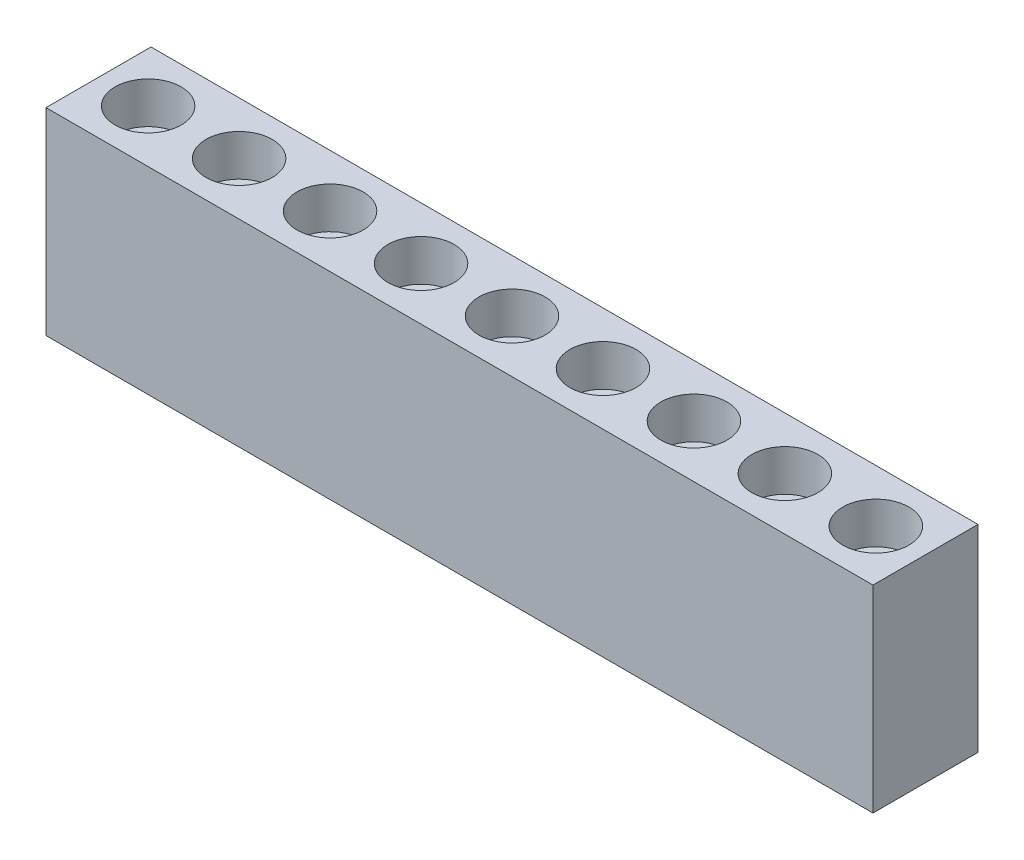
ISO-10303-21;
HEADER;
FILE_DESCRIPTION(('STEP AP214'),'2;1');
FILE_NAME('part.step','',(''),(''),'','','');
FILE_SCHEMA(('AUTOMOTIVE_DESIGN { 1 0 10303 214 1 1 1 1 }'));
ENDSEC;
DATA;
#1=APPLICATION_CONTEXT('core data for automotive mechanical design processes');
#2=APPLICATION_PROTOCOL_DEFINITION('international standard','automotive_design',2000,#1);
#3=PRODUCT_CONTEXT('',#1,'mechanical');
#4=PRODUCT('Part','Part','',(#3));
#5=PRODUCT_RELATED_PRODUCT_CATEGORY('part','',(#4));
#6=PRODUCT_DEFINITION_FORMATION('','',#4);
#7=PRODUCT_DEFINITION_CONTEXT('part definition',#1,'design');
#8=PRODUCT_DEFINITION('design','',#6,#7);
#9=PRODUCT_DEFINITION_SHAPE('','',#8);
#10=(LENGTH_UNIT() NAMED_UNIT(*) SI_UNIT(.MILLI.,.METRE.));
#11=(NAMED_UNIT(*) PLANE_ANGLE_UNIT() SI_UNIT($,.RADIAN.));
#12=(NAMED_UNIT(*) SI_UNIT($,.STERADIAN.) SOLID_ANGLE_UNIT());
#13=UNCERTAINTY_MEASURE_WITH_UNIT(LENGTH_MEASURE(1.E-05),#10,'distance_accuracy_value','');
#14=(GEOMETRIC_REPRESENTATION_CONTEXT(3) GLOBAL_UNCERTAINTY_ASSIGNED_CONTEXT((#13)) GLOBAL_UNIT_ASSIGNED_CONTEXT((#10,
#11,#12)) REPRESENTATION_CONTEXT('',''));
#15=CARTESIAN_POINT('',(0.,0.,0.));
#16=DIRECTION('',(0.,0.,1.));
#17=DIRECTION('',(1.,0.,0.));
#18=AXIS2_PLACEMENT_3D('',#15,#16,#17);
#19=CARTESIAN_POINT('',(88.,-35.1887084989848,0.));
#20=DIRECTION('',(0.,1.,0.));
#21=DIRECTION('',(-1.,0.,0.));
#22=AXIS2_PLACEMENT_3D('',#19,#20,#21);
#23=CYLINDRICAL_SURFACE('',#22,4.00000000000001);
#24=CARTESIAN_POINT('',(88.,-23.875,0.));
#25=DIRECTION('',(0.,1.,0.));
#26=DIRECTION('',(-1.,0.,0.));
#27=AXIS2_PLACEMENT_3D('',#24,#25,#26);
#28=CIRCLE('',#27,4.00000000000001);
#29=CARTESIAN_POINT('',(84.,-23.875,0.));
#30=VERTEX_POINT('',#29);
#31=EDGE_CURVE('E227',#30,#30,#28,.F.);
#32=ORIENTED_EDGE('',*,*,#31,.T.);
#33=EDGE_LOOP('',(#32));
#34=FACE_BOUND('',#33,.T.);
#35=CARTESIAN_POINT('',(88.,13.875,0.));
#36=DIRECTION('',(0.,1.,0.));
#37=DIRECTION('',(-1.,0.,0.));
#38=AXIS2_PLACEMENT_3D('',#35,#36,#37);
#39=CIRCLE('',#38,4.00000000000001);
#40=CARTESIAN_POINT('',(84.,13.875,0.));
#41=VERTEX_POINT('',#40);
#42=EDGE_CURVE('E11',#41,#41,#39,.T.);
#43=ORIENTED_EDGE('',*,*,#42,.T.);
#44=EDGE_LOOP('',(#43));
#45=FACE_BOUND('',#44,.T.);
#46=ADVANCED_FACE('F39',(#34,#45),#23,.F.);
#47=CARTESIAN_POINT('',(88.,13.875,0.));
#48=DIRECTION('',(0.,1.,0.));
#49=DIRECTION('',(-1.,0.,0.));
#50=AXIS2_PLACEMENT_3D('',#47,#48,#49);
#51=PLANE('',#50);
#52=ORIENTED_EDGE('',*,*,#42,.F.);
#53=EDGE_LOOP('',(#52));
#54=FACE_BOUND('',#53,.T.);
#55=CARTESIAN_POINT('',(88.,13.875,0.));
#56=DIRECTION('',(0.,1.,0.));
#57=DIRECTION('',(-1.,0.,0.));
#58=AXIS2_PLACEMENT_3D('',#55,#56,#57);
#59=CIRCLE('',#58,8.);
#60=CARTESIAN_POINT('',(80.,13.875,0.));
#61=VERTEX_POINT('',#60);
#62=EDGE_CURVE('E48',#61,#61,#59,.T.);
#63=ORIENTED_EDGE('',*,*,#62,.T.);
#64=EDGE_LOOP('',(#63));
#65=FACE_BOUND('',#64,.T.);
#66=ADVANCED_FACE('F238',(#54,#65),#51,.T.);
#67=CARTESIAN_POINT('',(88.,13.875,0.));
#68=DIRECTION('',(0.,1.,0.));
#69=DIRECTION('',(-1.,0.,0.));
#70=AXIS2_PLACEMENT_3D('',#67,#68,#69);
#71=CYLINDRICAL_SURFACE('',#70,8.);
#72=ORIENTED_EDGE('',*,*,#62,.F.);
#73=EDGE_LOOP('',(#72));
#74=FACE_BOUND('',#73,.T.);
#75=CARTESIAN_POINT('',(88.,23.875,0.));
#76=DIRECTION('',(0.,1.,0.));
#77=DIRECTION('',(-1.,0.,0.));
#78=AXIS2_PLACEMENT_3D('',#75,#76,#77);
#79=CIRCLE('',#78,8.);
#80=CARTESIAN_POINT('',(80.,23.875,0.));
#81=VERTEX_POINT('',#80);
#82=EDGE_CURVE('E230',#81,#81,#79,.T.);
#83=ORIENTED_EDGE('',*,*,#82,.T.);
#84=EDGE_LOOP('',(#83));
#85=FACE_BOUND('',#84,.T.);
#86=ADVANCED_FACE('F240',(#74,#85),#71,.F.);
#87=CARTESIAN_POINT('',(66.,-35.1887084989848,0.));
#88=DIRECTION('',(0.,1.,0.));
#89=DIRECTION('',(-1.,0.,0.));
#90=AXIS2_PLACEMENT_3D('',#87,#88,#89);
#91=CYLINDRICAL_SURFACE('',#90,4.00000000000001);
#92=CARTESIAN_POINT('',(66.,-23.875,0.));
#93=DIRECTION('',(0.,1.,0.));
#94=DIRECTION('',(-1.,0.,0.));
#95=AXIS2_PLACEMENT_3D('',#92,#93,#94);
#96=CIRCLE('',#95,4.00000000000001);
#97=CARTESIAN_POINT('',(62.,-23.875,0.));
#98=VERTEX_POINT('',#97);
#99=EDGE_CURVE('E211',#98,#98,#96,.F.);
#100=ORIENTED_EDGE('',*,*,#99,.T.);
#101=EDGE_LOOP('',(#100));
#102=FACE_BOUND('',#101,.T.);
#103=CARTESIAN_POINT('',(66.,13.875,0.));
#104=DIRECTION('',(0.,1.,0.));
#105=DIRECTION('',(-1.,0.,0.));
#106=AXIS2_PLACEMENT_3D('',#103,#104,#105);
#107=CIRCLE('',#106,4.00000000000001);
#108=CARTESIAN_POINT('',(62.,13.875,0.));
#109=VERTEX_POINT('',#108);
#110=EDGE_CURVE('E223',#109,#109,#107,.T.);
#111=ORIENTED_EDGE('',*,*,#110,.T.);
#112=EDGE_LOOP('',(#111));
#113=FACE_BOUND('',#112,.T.);
#114=ADVANCED_FACE('F243',(#102,#113),#91,.F.);
#115=CARTESIAN_POINT('',(66.,13.875,0.));
#116=DIRECTION('',(0.,1.,0.));
#117=DIRECTION('',(-1.,0.,0.));
#118=AXIS2_PLACEMENT_3D('',#115,#116,#117);
#119=PLANE('',#118);
#120=ORIENTED_EDGE('',*,*,#110,.F.);
#121=EDGE_LOOP('',(#120));
#122=FACE_BOUND('',#121,.T.);
#123=CARTESIAN_POINT('',(66.,13.875,0.));
#124=DIRECTION('',(0.,1.,0.));
#125=DIRECTION('',(-1.,0.,0.));
#126=AXIS2_PLACEMENT_3D('',#123,#124,#125);
#127=CIRCLE('',#126,8.);
#128=CARTESIAN_POINT('',(58.,13.875,0.));
#129=VERTEX_POINT('',#128);
#130=EDGE_CURVE('E219',#129,#129,#127,.T.);
#131=ORIENTED_EDGE('',*,*,#130,.T.);
#132=EDGE_LOOP('',(#131));
#133=FACE_BOUND('',#132,.T.);
#134=ADVANCED_FACE('F346',(#122,#133),#119,.T.);
#135=CARTESIAN_POINT('',(66.,13.875,0.));
#136=DIRECTION('',(0.,1.,0.));
#137=DIRECTION('',(-1.,0.,0.));
#138=AXIS2_PLACEMENT_3D('',#135,#136,#137);
#139=CYLINDRICAL_SURFACE('',#138,8.);
#140=ORIENTED_EDGE('',*,*,#130,.F.);
#141=EDGE_LOOP('',(#140));
#142=FACE_BOUND('',#141,.T.);
#143=CARTESIAN_POINT('',(66.,23.875,0.));
#144=DIRECTION('',(0.,1.,0.));
#145=DIRECTION('',(-1.,0.,0.));
#146=AXIS2_PLACEMENT_3D('',#143,#144,#145);
#147=CIRCLE('',#146,8.);
#148=CARTESIAN_POINT('',(58.,23.875,0.));
#149=VERTEX_POINT('',#148);
#150=EDGE_CURVE('E215',#149,#149,#147,.T.);
#151=ORIENTED_EDGE('',*,*,#150,.T.);
#152=EDGE_LOOP('',(#151));
#153=FACE_BOUND('',#152,.T.);
#154=ADVANCED_FACE('F342',(#142,#153),#139,.F.);
#155=CARTESIAN_POINT('',(44.,-35.1887084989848,0.));
#156=DIRECTION('',(0.,1.,0.));
#157=DIRECTION('',(-1.,0.,0.));
#158=AXIS2_PLACEMENT_3D('',#155,#156,#157);
#159=CYLINDRICAL_SURFACE('',#158,4.00000000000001);
#160=CARTESIAN_POINT('',(44.,-23.875,0.));
#161=DIRECTION('',(0.,1.,0.));
#162=DIRECTION('',(-1.,0.,0.));
#163=AXIS2_PLACEMENT_3D('',#160,#161,#162);
#164=CIRCLE('',#163,4.00000000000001);
#165=CARTESIAN_POINT('',(40.,-23.875,0.));
#166=VERTEX_POINT('',#165);
#167=EDGE_CURVE('E195',#166,#166,#164,.F.);
#168=ORIENTED_EDGE('',*,*,#167,.T.);
#169=EDGE_LOOP('',(#168));
#170=FACE_BOUND('',#169,.T.);
#171=CARTESIAN_POINT('',(44.,13.875,0.));
#172=DIRECTION('',(0.,1.,0.));
#173=DIRECTION('',(-1.,0.,0.));
#174=AXIS2_PLACEMENT_3D('',#171,#172,#173);
#175=CIRCLE('',#174,4.00000000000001);
#176=CARTESIAN_POINT('',(40.,13.875,0.));
#177=VERTEX_POINT('',#176);
#178=EDGE_CURVE('E207',#177,#177,#175,.T.);
#179=ORIENTED_EDGE('',*,*,#178,.T.);
#180=EDGE_LOOP('',(#179));
#181=FACE_BOUND('',#180,.T.);
#182=ADVANCED_FACE('F338',(#170,#181),#159,.F.);
#183=CARTESIAN_POINT('',(44.,13.875,0.));
#184=DIRECTION('',(0.,1.,0.));
#185=DIRECTION('',(-1.,0.,0.));
#186=AXIS2_PLACEMENT_3D('',#183,#184,#185);
#187=PLANE('',#186);
#188=ORIENTED_EDGE('',*,*,#178,.F.);
#189=EDGE_LOOP('',(#188));
#190=FACE_BOUND('',#189,.T.);
#191=CARTESIAN_POINT('',(44.,13.875,0.));
#192=DIRECTION('',(0.,1.,0.));
#193=DIRECTION('',(-1.,0.,0.));
#194=AXIS2_PLACEMENT_3D('',#191,#192,#193);
#195=CIRCLE('',#194,8.);
#196=CARTESIAN_POINT('',(36.,13.875,0.));
#197=VERTEX_POINT('',#196);
#198=EDGE_CURVE('E203',#197,#197,#195,.T.);
#199=ORIENTED_EDGE('',*,*,#198,.T.);
#200=EDGE_LOOP('',(#199));
#201=FACE_BOUND('',#200,.T.);
#202=ADVANCED_FACE('F334',(#190,#201),#187,.T.);
#203=CARTESIAN_POINT('',(44.,13.875,0.));
#204=DIRECTION('',(0.,1.,0.));
#205=DIRECTION('',(-1.,0.,0.));
#206=AXIS2_PLACEMENT_3D('',#203,#204,#205);
#207=CYLINDRICAL_SURFACE('',#206,8.);
#208=ORIENTED_EDGE('',*,*,#198,.F.);
#209=EDGE_LOOP('',(#208));
#210=FACE_BOUND('',#209,.T.);
#211=CARTESIAN_POINT('',(44.,23.875,0.));
#212=DIRECTION('',(0.,1.,0.));
#213=DIRECTION('',(-1.,0.,0.));
#214=AXIS2_PLACEMENT_3D('',#211,#212,#213);
#215=CIRCLE('',#214,8.);
#216=CARTESIAN_POINT('',(36.,23.875,0.));
#217=VERTEX_POINT('',#216);
#218=EDGE_CURVE('E199',#217,#217,#215,.T.);
#219=ORIENTED_EDGE('',*,*,#218,.T.);
#220=EDGE_LOOP('',(#219));
#221=FACE_BOUND('',#220,.T.);
#222=ADVANCED_FACE('F330',(#210,#221),#207,.F.);
#223=CARTESIAN_POINT('',(22.,-35.1887084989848,0.));
#224=DIRECTION('',(0.,1.,0.));
#225=DIRECTION('',(-1.,0.,0.));
#226=AXIS2_PLACEMENT_3D('',#223,#224,#225);
#227=CYLINDRICAL_SURFACE('',#226,4.00000000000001);
#228=CARTESIAN_POINT('',(22.,-23.875,0.));
#229=DIRECTION('',(0.,1.,0.));
#230=DIRECTION('',(-1.,0.,0.));
#231=AXIS2_PLACEMENT_3D('',#228,#229,#230);
#232=CIRCLE('',#231,4.00000000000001);
#233=CARTESIAN_POINT('',(18.,-23.875,0.));
#234=VERTEX_POINT('',#233);
#235=EDGE_CURVE('E179',#234,#234,#232,.F.);
#236=ORIENTED_EDGE('',*,*,#235,.T.);
#237=EDGE_LOOP('',(#236));
#238=FACE_BOUND('',#237,.T.);
#239=CARTESIAN_POINT('',(22.,13.875,0.));
#240=DIRECTION('',(0.,1.,0.));
#241=DIRECTION('',(-1.,0.,0.));
#242=AXIS2_PLACEMENT_3D('',#239,#240,#241);
#243=CIRCLE('',#242,4.00000000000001);
#244=CARTESIAN_POINT('',(18.,13.875,0.));
#245=VERTEX_POINT('',#244);
#246=EDGE_CURVE('E191',#245,#245,#243,.T.);
#247=ORIENTED_EDGE('',*,*,#246,.T.);
#248=EDGE_LOOP('',(#247));
#249=FACE_BOUND('',#248,.T.);
#250=ADVANCED_FACE('F326',(#238,#249),#227,.F.);
#251=CARTESIAN_POINT('',(22.,13.875,0.));
#252=DIRECTION('',(0.,1.,0.));
#253=DIRECTION('',(-1.,0.,0.));
#254=AXIS2_PLACEMENT_3D('',#251,#252,#253);
#255=PLANE('',#254);
#256=ORIENTED_EDGE('',*,*,#246,.F.);
#257=EDGE_LOOP('',(#256));
#258=FACE_BOUND('',#257,.T.);
#259=CARTESIAN_POINT('',(22.,13.875,0.));
#260=DIRECTION('',(0.,1.,0.));
#261=DIRECTION('',(-1.,0.,0.));
#262=AXIS2_PLACEMENT_3D('',#259,#260,#261);
#263=CIRCLE('',#262,8.);
#264=CARTESIAN_POINT('',(14.,13.875,0.));
#265=VERTEX_POINT('',#264);
#266=EDGE_CURVE('E187',#265,#265,#263,.T.);
#267=ORIENTED_EDGE('',*,*,#266,.T.);
#268=EDGE_LOOP('',(#267));
#269=FACE_BOUND('',#268,.T.);
#270=ADVANCED_FACE('F322',(#258,#269),#255,.T.);
#271=CARTESIAN_POINT('',(22.,13.875,0.));
#272=DIRECTION('',(0.,1.,0.));
#273=DIRECTION('',(-1.,0.,0.));
#274=AXIS2_PLACEMENT_3D('',#271,#272,#273);
#275=CYLINDRICAL_SURFACE('',#274,8.);
#276=ORIENTED_EDGE('',*,*,#266,.F.);
#277=EDGE_LOOP('',(#276));
#278=FACE_BOUND('',#277,.T.);
#279=CARTESIAN_POINT('',(22.,23.875,0.));
#280=DIRECTION('',(0.,1.,0.));
#281=DIRECTION('',(-1.,0.,0.));
#282=AXIS2_PLACEMENT_3D('',#279,#280,#281);
#283=CIRCLE('',#282,8.);
#284=CARTESIAN_POINT('',(14.,23.875,0.));
#285=VERTEX_POINT('',#284);
#286=EDGE_CURVE('E183',#285,#285,#283,.T.);
#287=ORIENTED_EDGE('',*,*,#286,.T.);
#288=EDGE_LOOP('',(#287));
#289=FACE_BOUND('',#288,.T.);
#290=ADVANCED_FACE('F318',(#278,#289),#275,.F.);
#291=CARTESIAN_POINT('',(0.,-35.1887084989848,0.));
#292=DIRECTION('',(0.,1.,0.));
#293=DIRECTION('',(-1.,0.,0.));
#294=AXIS2_PLACEMENT_3D('',#291,#292,#293);
#295=CYLINDRICAL_SURFACE('',#294,4.00000000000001);
#296=CARTESIAN_POINT('',(0.,-23.875,0.));
#297=DIRECTION('',(0.,1.,0.));
#298=DIRECTION('',(-1.,0.,0.));
#299=AXIS2_PLACEMENT_3D('',#296,#297,#298);
#300=CIRCLE('',#299,4.00000000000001);
#301=CARTESIAN_POINT('',(-4.00000000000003,-23.875,0.));
#302=VERTEX_POINT('',#301);
#303=EDGE_CURVE('E163',#302,#302,#300,.F.);
#304=ORIENTED_EDGE('',*,*,#303,.T.);
#305=EDGE_LOOP('',(#304));
#306=FACE_BOUND('',#305,.T.);
#307=CARTESIAN_POINT('',(0.,13.875,0.));
#308=DIRECTION('',(0.,1.,0.));
#309=DIRECTION('',(-1.,0.,0.));
#310=AXIS2_PLACEMENT_3D('',#307,#308,#309);
#311=CIRCLE('',#310,4.00000000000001);
#312=CARTESIAN_POINT('',(-4.00000000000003,13.875,0.));
#313=VERTEX_POINT('',#312);
#314=EDGE_CURVE('E175',#313,#313,#311,.T.);
#315=ORIENTED_EDGE('',*,*,#314,.T.);
#316=EDGE_LOOP('',(#315));
#317=FACE_BOUND('',#316,.T.);
#318=ADVANCED_FACE('F314',(#306,#317),#295,.F.);
#319=CARTESIAN_POINT('',(0.,13.875,0.));
#320=DIRECTION('',(0.,1.,0.));
#321=DIRECTION('',(-1.,0.,0.));
#322=AXIS2_PLACEMENT_3D('',#319,#320,#321);
#323=PLANE('',#322);
#324=ORIENTED_EDGE('',*,*,#314,.F.);
#325=EDGE_LOOP('',(#324));
#326=FACE_BOUND('',#325,.T.);
#327=CARTESIAN_POINT('',(0.,13.875,0.));
#328=DIRECTION('',(0.,1.,0.));
#329=DIRECTION('',(-1.,0.,0.));
#330=AXIS2_PLACEMENT_3D('',#327,#328,#329);
#331=CIRCLE('',#330,8.);
#332=CARTESIAN_POINT('',(-8.00000000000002,13.875,0.));
#333=VERTEX_POINT('',#332);
#334=EDGE_CURVE('E171',#333,#333,#331,.T.);
#335=ORIENTED_EDGE('',*,*,#334,.T.);
#336=EDGE_LOOP('',(#335));
#337=FACE_BOUND('',#336,.T.);
#338=ADVANCED_FACE('F310',(#326,#337),#323,.T.);
#339=CARTESIAN_POINT('',(0.,13.875,0.));
#340=DIRECTION('',(0.,1.,0.));
#341=DIRECTION('',(-1.,0.,0.));
#342=AXIS2_PLACEMENT_3D('',#339,#340,#341);
#343=CYLINDRICAL_SURFACE('',#342,8.);
#344=ORIENTED_EDGE('',*,*,#334,.F.);
#345=EDGE_LOOP('',(#344));
#346=FACE_BOUND('',#345,.T.);
#347=CARTESIAN_POINT('',(0.,23.875,0.));
#348=DIRECTION('',(0.,1.,0.));
#349=DIRECTION('',(-1.,0.,0.));
#350=AXIS2_PLACEMENT_3D('',#347,#348,#349);
#351=CIRCLE('',#350,8.);
#352=CARTESIAN_POINT('',(-8.00000000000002,23.875,0.));
#353=VERTEX_POINT('',#352);
#354=EDGE_CURVE('E167',#353,#353,#351,.T.);
#355=ORIENTED_EDGE('',*,*,#354,.T.);
#356=EDGE_LOOP('',(#355));
#357=FACE_BOUND('',#356,.T.);
#358=ADVANCED_FACE('F306',(#346,#357),#343,.F.);
#359=CARTESIAN_POINT('',(-22.,-35.1887084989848,0.));
#360=DIRECTION('',(0.,1.,0.));
#361=DIRECTION('',(-1.,0.,0.));
#362=AXIS2_PLACEMENT_3D('',#359,#360,#361);
#363=CYLINDRICAL_SURFACE('',#362,4.00000000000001);
#364=CARTESIAN_POINT('',(-22.,-23.875,0.));
#365=DIRECTION('',(0.,1.,0.));
#366=DIRECTION('',(-1.,0.,0.));
#367=AXIS2_PLACEMENT_3D('',#364,#365,#366);
#368=CIRCLE('',#367,4.00000000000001);
#369=CARTESIAN_POINT('',(-26.,-23.875,0.));
#370=VERTEX_POINT('',#369);
#371=EDGE_CURVE('E147',#370,#370,#368,.F.);
#372=ORIENTED_EDGE('',*,*,#371,.T.);
#373=EDGE_LOOP('',(#372));
#374=FACE_BOUND('',#373,.T.);
#375=CARTESIAN_POINT('',(-22.,13.875,0.));
#376=DIRECTION('',(0.,1.,0.));
#377=DIRECTION('',(-1.,0.,0.));
#378=AXIS2_PLACEMENT_3D('',#375,#376,#377);
#379=CIRCLE('',#378,4.00000000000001);
#380=CARTESIAN_POINT('',(-26.,13.875,0.));
#381=VERTEX_POINT('',#380);
#382=EDGE_CURVE('E159',#381,#381,#379,.T.);
#383=ORIENTED_EDGE('',*,*,#382,.T.);
#384=EDGE_LOOP('',(#383));
#385=FACE_BOUND('',#384,.T.);
#386=ADVANCED_FACE('F302',(#374,#385),#363,.F.);
#387=CARTESIAN_POINT('',(-22.,13.875,0.));
#388=DIRECTION('',(0.,1.,0.));
#389=DIRECTION('',(-1.,0.,0.));
#390=AXIS2_PLACEMENT_3D('',#387,#388,#389);
#391=PLANE('',#390);
#392=ORIENTED_EDGE('',*,*,#382,.F.);
#393=EDGE_LOOP('',(#392));
#394=FACE_BOUND('',#393,.T.);
#395=CARTESIAN_POINT('',(-22.,13.875,0.));
#396=DIRECTION('',(0.,1.,0.));
#397=DIRECTION('',(-1.,0.,0.));
#398=AXIS2_PLACEMENT_3D('',#395,#396,#397);
#399=CIRCLE('',#398,8.);
#400=CARTESIAN_POINT('',(-30.,13.875,0.));
#401=VERTEX_POINT('',#400);
#402=EDGE_CURVE('E155',#401,#401,#399,.T.);
#403=ORIENTED_EDGE('',*,*,#402,.T.);
#404=EDGE_LOOP('',(#403));
#405=FACE_BOUND('',#404,.T.);
#406=ADVANCED_FACE('F298',(#394,#405),#391,.T.);
#407=CARTESIAN_POINT('',(-22.,13.875,0.));
#408=DIRECTION('',(0.,1.,0.));
#409=DIRECTION('',(-1.,0.,0.));
#410=AXIS2_PLACEMENT_3D('',#407,#408,#409);
#411=CYLINDRICAL_SURFACE('',#410,8.);
#412=ORIENTED_EDGE('',*,*,#402,.F.);
#413=EDGE_LOOP('',(#412));
#414=FACE_BOUND('',#413,.T.);
#415=CARTESIAN_POINT('',(-22.,23.875,0.));
#416=DIRECTION('',(0.,1.,0.));
#417=DIRECTION('',(-1.,0.,0.));
#418=AXIS2_PLACEMENT_3D('',#415,#416,#417);
#419=CIRCLE('',#418,8.);
#420=CARTESIAN_POINT('',(-30.,23.875,0.));
#421=VERTEX_POINT('',#420);
#422=EDGE_CURVE('E151',#421,#421,#419,.T.);
#423=ORIENTED_EDGE('',*,*,#422,.T.);
#424=EDGE_LOOP('',(#423));
#425=FACE_BOUND('',#424,.T.);
#426=ADVANCED_FACE('F294',(#414,#425),#411,.F.);
#427=CARTESIAN_POINT('',(-44.,-35.1887084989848,0.));
#428=DIRECTION('',(0.,1.,0.));
#429=DIRECTION('',(-1.,0.,0.));
#430=AXIS2_PLACEMENT_3D('',#427,#428,#429);
#431=CYLINDRICAL_SURFACE('',#430,4.00000000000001);
#432=CARTESIAN_POINT('',(-44.,-23.875,0.));
#433=DIRECTION('',(0.,1.,0.));
#434=DIRECTION('',(-1.,0.,0.));
#435=AXIS2_PLACEMENT_3D('',#432,#433,#434);
#436=CIRCLE('',#435,4.00000000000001);
#437=CARTESIAN_POINT('',(-48.,-23.875,0.));
#438=VERTEX_POINT('',#437);
#439=EDGE_CURVE('E131',#438,#438,#436,.F.);
#440=ORIENTED_EDGE('',*,*,#439,.T.);
#441=EDGE_LOOP('',(#440));
#442=FACE_BOUND('',#441,.T.);
#443=CARTESIAN_POINT('',(-44.,13.875,0.));
#444=DIRECTION('',(0.,1.,0.));
#445=DIRECTION('',(-1.,0.,0.));
#446=AXIS2_PLACEMENT_3D('',#443,#444,#445);
#447=CIRCLE('',#446,4.00000000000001);
#448=CARTESIAN_POINT('',(-48.,13.875,0.));
#449=VERTEX_POINT('',#448);
#450=EDGE_CURVE('E143',#449,#449,#447,.T.);
#451=ORIENTED_EDGE('',*,*,#450,.T.);
#452=EDGE_LOOP('',(#451));
#453=FACE_BOUND('',#452,.T.);
#454=ADVANCED_FACE('F290',(#442,#453),#431,.F.);
#455=CARTESIAN_POINT('',(-44.,13.875,0.));
#456=DIRECTION('',(0.,1.,0.));
#457=DIRECTION('',(-1.,0.,0.));
#458=AXIS2_PLACEMENT_3D('',#455,#456,#457);
#459=PLANE('',#458);
#460=ORIENTED_EDGE('',*,*,#450,.F.);
#461=EDGE_LOOP('',(#460));
#462=FACE_BOUND('',#461,.T.);
#463=CARTESIAN_POINT('',(-44.,13.875,0.));
#464=DIRECTION('',(0.,1.,0.));
#465=DIRECTION('',(-1.,0.,0.));
#466=AXIS2_PLACEMENT_3D('',#463,#464,#465);
#467=CIRCLE('',#466,8.);
#468=CARTESIAN_POINT('',(-52.,13.875,0.));
#469=VERTEX_POINT('',#468);
#470=EDGE_CURVE('E139',#469,#469,#467,.T.);
#471=ORIENTED_EDGE('',*,*,#470,.T.);
#472=EDGE_LOOP('',(#471));
#473=FACE_BOUND('',#472,.T.);
#474=ADVANCED_FACE('F286',(#462,#473),#459,.T.);
#475=CARTESIAN_POINT('',(-44.,13.875,0.));
#476=DIRECTION('',(0.,1.,0.));
#477=DIRECTION('',(-1.,0.,0.));
#478=AXIS2_PLACEMENT_3D('',#475,#476,#477);
#479=CYLINDRICAL_SURFACE('',#478,8.);
#480=ORIENTED_EDGE('',*,*,#470,.F.);
#481=EDGE_LOOP('',(#480));
#482=FACE_BOUND('',#481,.T.);
#483=CARTESIAN_POINT('',(-44.,23.875,0.));
#484=DIRECTION('',(0.,1.,0.));
#485=DIRECTION('',(-1.,0.,0.));
#486=AXIS2_PLACEMENT_3D('',#483,#484,#485);
#487=CIRCLE('',#486,8.);
#488=CARTESIAN_POINT('',(-52.,23.875,0.));
#489=VERTEX_POINT('',#488);
#490=EDGE_CURVE('E135',#489,#489,#487,.T.);
#491=ORIENTED_EDGE('',*,*,#490,.T.);
#492=EDGE_LOOP('',(#491));
#493=FACE_BOUND('',#492,.T.);
#494=ADVANCED_FACE('F278',(#482,#493),#479,.F.);
#495=CARTESIAN_POINT('',(-100.,-23.875,12.7));
#496=DIRECTION('',(1.,0.,0.));
#497=DIRECTION('',(0.,0.,-1.));
#498=AXIS2_PLACEMENT_3D('',#495,#496,#497);
#499=PLANE('',#498);
#500=DIRECTION('',(0.,-1.,0.));
#501=VECTOR('',#500,1.);
#502=CARTESIAN_POINT('',(-100.,-23.875,-12.7));
#503=LINE('',#502,#501);
#504=CARTESIAN_POINT('',(-100.,23.875,-12.7));
#505=VERTEX_POINT('',#504);
#506=CARTESIAN_POINT('',(-100.,-23.875,-12.7));
#507=VERTEX_POINT('',#506);
#508=EDGE_CURVE('E114',#505,#507,#503,.T.);
#509=ORIENTED_EDGE('',*,*,#508,.T.);
#510=DIRECTION('',(0.,0.,-1.));
#511=VECTOR('',#510,1.);
#512=CARTESIAN_POINT('',(-100.,-23.875,12.7));
#513=LINE('',#512,#511);
#514=CARTESIAN_POINT('',(-100.,-23.875,12.7));
#515=VERTEX_POINT('',#514);
#516=EDGE_CURVE('E101',#515,#507,#513,.T.);
#517=ORIENTED_EDGE('',*,*,#516,.F.);
#518=DIRECTION('',(0.,-1.,0.));
#519=VECTOR('',#518,1.);
#520=CARTESIAN_POINT('',(-100.,-23.875,12.7));
#521=LINE('',#520,#519);
#522=CARTESIAN_POINT('',(-100.,23.875,12.7));
#523=VERTEX_POINT('',#522);
#524=EDGE_CURVE('E92',#523,#515,#521,.T.);
#525=ORIENTED_EDGE('',*,*,#524,.F.);
#526=DIRECTION('',(0.,0.,-1.));
#527=VECTOR('',#526,1.);
#528=CARTESIAN_POINT('',(-100.,23.875,12.7));
#529=LINE('',#528,#527);
#530=EDGE_CURVE('E110',#523,#505,#529,.T.);
#531=ORIENTED_EDGE('',*,*,#530,.T.);
#532=EDGE_LOOP('',(#509,#517,#525,#531));
#533=FACE_BOUND('',#532,.T.);
#534=ADVANCED_FACE('F272',(#533),#499,.F.);
#535=CARTESIAN_POINT('',(100.,-23.875,12.7));
#536=DIRECTION('',(0.,1.,0.));
#537=DIRECTION('',(-1.,0.,0.));
#538=AXIS2_PLACEMENT_3D('',#535,#536,#537);
#539=PLANE('',#538);
#540=CARTESIAN_POINT('',(-66.,-23.875,0.));
#541=DIRECTION('',(0.,1.,0.));
#542=DIRECTION('',(-1.,0.,0.));
#543=AXIS2_PLACEMENT_3D('',#540,#541,#542);
#544=CIRCLE('',#543,4.00000000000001);
#545=CARTESIAN_POINT('',(-70.,-23.875,0.));
#546=VERTEX_POINT('',#545);
#547=EDGE_CURVE('E615',#546,#546,#544,.F.);
#548=ORIENTED_EDGE('',*,*,#547,.F.);
#549=EDGE_LOOP('',(#548));
#550=FACE_BOUND('',#549,.T.);
#551=CARTESIAN_POINT('',(-88.,-23.875,0.));
#552=DIRECTION('',(0.,1.,0.));
#553=DIRECTION('',(-1.,0.,0.));
#554=AXIS2_PLACEMENT_3D('',#551,#552,#553);
#555=CIRCLE('',#554,4.00000000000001);
#556=CARTESIAN_POINT('',(-92.,-23.875,0.));
#557=VERTEX_POINT('',#556);
#558=EDGE_CURVE('E633',#557,#557,#555,.F.);
#559=ORIENTED_EDGE('',*,*,#558,.F.);
#560=EDGE_LOOP('',(#559));
#561=FACE_BOUND('',#560,.T.);
#562=DIRECTION('',(1.,0.,0.));
#563=VECTOR('',#562,1.);
#564=CARTESIAN_POINT('',(100.,-23.875,-12.7));
#565=LINE('',#564,#563);
#566=CARTESIAN_POINT('',(100.,-23.875,-12.7));
#567=VERTEX_POINT('',#566);
#568=EDGE_CURVE('E99',#507,#567,#565,.T.);
#569=ORIENTED_EDGE('',*,*,#568,.T.);
#570=DIRECTION('',(0.,0.,-1.));
#571=VECTOR('',#570,1.);
#572=CARTESIAN_POINT('',(100.,-23.875,12.7));
#573=LINE('',#572,#571);
#574=CARTESIAN_POINT('',(100.,-23.875,12.7));
#575=VERTEX_POINT('',#574);
#576=EDGE_CURVE('E96',#575,#567,#573,.T.);
#577=ORIENTED_EDGE('',*,*,#576,.F.);
#578=DIRECTION('',(1.,0.,0.));
#579=VECTOR('',#578,1.);
#580=CARTESIAN_POINT('',(100.,-23.875,12.7));
#581=LINE('',#580,#579);
#582=EDGE_CURVE('E87',#515,#575,#581,.T.);
#583=ORIENTED_EDGE('',*,*,#582,.F.);
#584=ORIENTED_EDGE('',*,*,#516,.T.);
#585=EDGE_LOOP('',(#569,#577,#583,#584));
#586=FACE_BOUND('',#585,.T.);
#587=ORIENTED_EDGE('',*,*,#439,.F.);
#588=EDGE_LOOP('',(#587));
#589=FACE_BOUND('',#588,.T.);
#590=ORIENTED_EDGE('',*,*,#371,.F.);
#591=EDGE_LOOP('',(#590));
#592=FACE_BOUND('',#591,.T.);
#593=ORIENTED_EDGE('',*,*,#303,.F.);
#594=EDGE_LOOP('',(#593));
#595=FACE_BOUND('',#594,.T.);
#596=ORIENTED_EDGE('',*,*,#235,.F.);
#597=EDGE_LOOP('',(#596));
#598=FACE_BOUND('',#597,.T.);
#599=ORIENTED_EDGE('',*,*,#167,.F.);
#600=EDGE_LOOP('',(#599));
#601=FACE_BOUND('',#600,.T.);
#602=ORIENTED_EDGE('',*,*,#99,.F.);
#603=EDGE_LOOP('',(#602));
#604=FACE_BOUND('',#603,.T.);
#605=ORIENTED_EDGE('',*,*,#31,.F.);
#606=EDGE_LOOP('',(#605));
#607=FACE_BOUND('',#606,.T.);
#608=ADVANCED_FACE('F97',(#550,#561,#586,#589,#592,#595,#598,#601,#604,#607),#539,.F.);
#609=CARTESIAN_POINT('',(100.,-23.875,12.7));
#610=DIRECTION('',(-1.,0.,0.));
#611=DIRECTION('',(0.,0.,1.));
#612=AXIS2_PLACEMENT_3D('',#609,#610,#611);
#613=PLANE('',#612);
#614=DIRECTION('',(0.,1.,0.));
#615=VECTOR('',#614,1.);
#616=CARTESIAN_POINT('',(100.,-23.875,-12.7));
#617=LINE('',#616,#615);
#618=CARTESIAN_POINT('',(100.,23.875,-12.7));
#619=VERTEX_POINT('',#618);
#620=EDGE_CURVE('E73',#567,#619,#617,.T.);
#621=ORIENTED_EDGE('',*,*,#620,.T.);
#622=DIRECTION('',(0.,0.,-1.));
#623=VECTOR('',#622,1.);
#624=CARTESIAN_POINT('',(100.,23.875,12.7));
#625=LINE('',#624,#623);
#626=CARTESIAN_POINT('',(100.,23.875,12.7));
#627=VERTEX_POINT('',#626);
#628=EDGE_CURVE('E102',#627,#619,#625,.T.);
#629=ORIENTED_EDGE('',*,*,#628,.F.);
#630=DIRECTION('',(0.,1.,0.));
#631=VECTOR('',#630,1.);
#632=CARTESIAN_POINT('',(100.,-23.875,12.7));
#633=LINE('',#632,#631);
#634=EDGE_CURVE('E90',#575,#627,#633,.T.);
#635=ORIENTED_EDGE('',*,*,#634,.F.);
#636=ORIENTED_EDGE('',*,*,#576,.T.);
#637=EDGE_LOOP('',(#621,#629,#635,#636));
#638=FACE_BOUND('',#637,.T.);
#639=ADVANCED_FACE('F104',(#638),#613,.F.);
#640=CARTESIAN_POINT('',(100.,23.875,12.7));
#641=DIRECTION('',(0.,-1.,0.));
#642=DIRECTION('',(1.,0.,0.));
#643=AXIS2_PLACEMENT_3D('',#640,#641,#642);
#644=PLANE('',#643);
#645=CARTESIAN_POINT('',(-66.,23.875,0.));
#646=DIRECTION('',(0.,1.,0.));
#647=DIRECTION('',(-1.,0.,0.));
#648=AXIS2_PLACEMENT_3D('',#645,#646,#647);
#649=CIRCLE('',#648,8.);
#650=CARTESIAN_POINT('',(-74.,23.875,0.));
#651=VERTEX_POINT('',#650);
#652=EDGE_CURVE('E621',#651,#651,#649,.T.);
#653=ORIENTED_EDGE('',*,*,#652,.F.);
#654=EDGE_LOOP('',(#653));
#655=FACE_BOUND('',#654,.T.);
#656=CARTESIAN_POINT('',(-88.,23.875,0.));
#657=DIRECTION('',(0.,1.,0.));
#658=DIRECTION('',(-1.,0.,0.));
#659=AXIS2_PLACEMENT_3D('',#656,#657,#658);
#660=CIRCLE('',#659,8.);
#661=CARTESIAN_POINT('',(-96.,23.875,0.));
#662=VERTEX_POINT('',#661);
#663=EDGE_CURVE('E637',#662,#662,#660,.T.);
#664=ORIENTED_EDGE('',*,*,#663,.F.);
#665=EDGE_LOOP('',(#664));
#666=FACE_BOUND('',#665,.T.);
#667=DIRECTION('',(-1.,0.,0.));
#668=VECTOR('',#667,1.);
#669=CARTESIAN_POINT('',(100.,23.875,-12.7));
#670=LINE('',#669,#668);
#671=EDGE_CURVE('E79',#619,#505,#670,.T.);
#672=ORIENTED_EDGE('',*,*,#671,.T.);
#673=ORIENTED_EDGE('',*,*,#530,.F.);
#674=DIRECTION('',(-1.,0.,0.));
#675=VECTOR('',#674,1.);
#676=CARTESIAN_POINT('',(100.,23.875,12.7));
#677=LINE('',#676,#675);
#678=EDGE_CURVE('E56',#627,#523,#677,.T.);
#679=ORIENTED_EDGE('',*,*,#678,.F.);
#680=ORIENTED_EDGE('',*,*,#628,.T.);
#681=EDGE_LOOP('',(#672,#673,#679,#680));
#682=FACE_BOUND('',#681,.T.);
#683=ORIENTED_EDGE('',*,*,#490,.F.);
#684=EDGE_LOOP('',(#683));
#685=FACE_BOUND('',#684,.T.);
#686=ORIENTED_EDGE('',*,*,#422,.F.);
#687=EDGE_LOOP('',(#686));
#688=FACE_BOUND('',#687,.T.);
#689=ORIENTED_EDGE('',*,*,#354,.F.);
#690=EDGE_LOOP('',(#689));
#691=FACE_BOUND('',#690,.T.);
#692=ORIENTED_EDGE('',*,*,#286,.F.);
#693=EDGE_LOOP('',(#692));
#694=FACE_BOUND('',#693,.T.);
#695=ORIENTED_EDGE('',*,*,#218,.F.);
#696=EDGE_LOOP('',(#695));
#697=FACE_BOUND('',#696,.T.);
#698=ORIENTED_EDGE('',*,*,#150,.F.);
#699=EDGE_LOOP('',(#698));
#700=FACE_BOUND('',#699,.T.);
#701=ORIENTED_EDGE('',*,*,#82,.F.);
#702=EDGE_LOOP('',(#701));
#703=FACE_BOUND('',#702,.T.);
#704=ADVANCED_FACE('F247',(#655,#666,#682,#685,#688,#691,#694,#697,#700,#703),#644,.F.);
#705=CARTESIAN_POINT('',(0.,0.,12.7));
#706=DIRECTION('',(0.,0.,1.));
#707=DIRECTION('',(1.,0.,0.));
#708=AXIS2_PLACEMENT_3D('',#705,#706,#707);
#709=PLANE('',#708);
#710=ORIENTED_EDGE('',*,*,#524,.T.);
#711=ORIENTED_EDGE('',*,*,#582,.T.);
#712=ORIENTED_EDGE('',*,*,#634,.T.);
#713=ORIENTED_EDGE('',*,*,#678,.T.);
#714=EDGE_LOOP('',(#710,#711,#712,#713));
#715=FACE_BOUND('',#714,.T.);
#716=ADVANCED_FACE('F88',(#715),#709,.T.);
#717=CARTESIAN_POINT('',(0.,0.,-12.7));
#718=DIRECTION('',(0.,0.,1.));
#719=DIRECTION('',(1.,0.,0.));
#720=AXIS2_PLACEMENT_3D('',#717,#718,#719);
#721=PLANE('',#720);
#722=ORIENTED_EDGE('',*,*,#508,.F.);
#723=ORIENTED_EDGE('',*,*,#671,.F.);
#724=ORIENTED_EDGE('',*,*,#620,.F.);
#725=ORIENTED_EDGE('',*,*,#568,.F.);
#726=EDGE_LOOP('',(#722,#723,#724,#725));
#727=FACE_BOUND('',#726,.T.);
#728=ADVANCED_FACE('F255',(#727),#721,.F.);
#729=CARTESIAN_POINT('',(-88.,13.875,0.));
#730=DIRECTION('',(0.,1.,0.));
#731=DIRECTION('',(-1.,0.,0.));
#732=AXIS2_PLACEMENT_3D('',#729,#730,#731);
#733=CYLINDRICAL_SURFACE('',#732,8.);
#734=CARTESIAN_POINT('',(-88.,13.875,0.));
#735=DIRECTION('',(0.,1.,0.));
#736=DIRECTION('',(-1.,0.,0.));
#737=AXIS2_PLACEMENT_3D('',#734,#735,#736);
#738=CIRCLE('',#737,8.);
#739=CARTESIAN_POINT('',(-96.,13.875,0.));
#740=VERTEX_POINT('',#739);
#741=EDGE_CURVE('E118',#740,#740,#738,.T.);
#742=ORIENTED_EDGE('',*,*,#741,.F.);
#743=EDGE_LOOP('',(#742));
#744=FACE_BOUND('',#743,.T.);
#745=ORIENTED_EDGE('',*,*,#663,.T.);
#746=EDGE_LOOP('',(#745));
#747=FACE_BOUND('',#746,.T.);
#748=ADVANCED_FACE('F444',(#744,#747),#733,.F.);
#749=CARTESIAN_POINT('',(-88.,13.875,0.));
#750=DIRECTION('',(0.,1.,0.));
#751=DIRECTION('',(-1.,0.,0.));
#752=AXIS2_PLACEMENT_3D('',#749,#750,#751);
#753=PLANE('',#752);
#754=CARTESIAN_POINT('',(-88.,13.875,0.));
#755=DIRECTION('',(0.,1.,0.));
#756=DIRECTION('',(-1.,0.,0.));
#757=AXIS2_PLACEMENT_3D('',#754,#755,#756);
#758=CIRCLE('',#757,4.00000000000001);
#759=CARTESIAN_POINT('',(-92.,13.875,0.));
#760=VERTEX_POINT('',#759);
#761=EDGE_CURVE('E624',#760,#760,#758,.T.);
#762=ORIENTED_EDGE('',*,*,#761,.F.);
#763=EDGE_LOOP('',(#762));
#764=FACE_BOUND('',#763,.T.);
#765=ORIENTED_EDGE('',*,*,#741,.T.);
#766=EDGE_LOOP('',(#765));
#767=FACE_BOUND('',#766,.T.);
#768=ADVANCED_FACE('F452',(#764,#767),#753,.T.);
#769=CARTESIAN_POINT('',(-88.,-35.1887084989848,0.));
#770=DIRECTION('',(0.,1.,0.));
#771=DIRECTION('',(-1.,0.,0.));
#772=AXIS2_PLACEMENT_3D('',#769,#770,#771);
#773=CYLINDRICAL_SURFACE('',#772,4.00000000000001);
#774=ORIENTED_EDGE('',*,*,#558,.T.);
#775=EDGE_LOOP('',(#774));
#776=FACE_BOUND('',#775,.T.);
#777=ORIENTED_EDGE('',*,*,#761,.T.);
#778=EDGE_LOOP('',(#777));
#779=FACE_BOUND('',#778,.T.);
#780=ADVANCED_FACE('F461',(#776,#779),#773,.F.);
#781=CARTESIAN_POINT('',(-66.,13.875,0.));
#782=DIRECTION('',(0.,1.,0.));
#783=DIRECTION('',(-1.,0.,0.));
#784=AXIS2_PLACEMENT_3D('',#781,#782,#783);
#785=CYLINDRICAL_SURFACE('',#784,8.);
#786=CARTESIAN_POINT('',(-66.,13.875,0.));
#787=DIRECTION('',(0.,1.,0.));
#788=DIRECTION('',(-1.,0.,0.));
#789=AXIS2_PLACEMENT_3D('',#786,#787,#788);
#790=CIRCLE('',#789,8.);
#791=CARTESIAN_POINT('',(-74.,13.875,0.));
#792=VERTEX_POINT('',#791);
#793=EDGE_CURVE('E620',#792,#792,#790,.T.);
#794=ORIENTED_EDGE('',*,*,#793,.F.);
#795=EDGE_LOOP('',(#794));
#796=FACE_BOUND('',#795,.T.);
#797=ORIENTED_EDGE('',*,*,#652,.T.);
#798=EDGE_LOOP('',(#797));
#799=FACE_BOUND('',#798,.T.);
#800=ADVANCED_FACE('F470',(#796,#799),#785,.F.);
#801=CARTESIAN_POINT('',(-66.,13.875,0.));
#802=DIRECTION('',(0.,1.,0.));
#803=DIRECTION('',(-1.,0.,0.));
#804=AXIS2_PLACEMENT_3D('',#801,#802,#803);
#805=PLANE('',#804);
#806=CARTESIAN_POINT('',(-66.,13.875,0.));
#807=DIRECTION('',(0.,1.,0.));
#808=DIRECTION('',(-1.,0.,0.));
#809=AXIS2_PLACEMENT_3D('',#806,#807,#808);
#810=CIRCLE('',#809,4.00000000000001);
#811=CARTESIAN_POINT('',(-70.,13.875,0.));
#812=VERTEX_POINT('',#811);
#813=EDGE_CURVE('E618',#812,#812,#810,.T.);
#814=ORIENTED_EDGE('',*,*,#813,.F.);
#815=EDGE_LOOP('',(#814));
#816=FACE_BOUND('',#815,.T.);
#817=ORIENTED_EDGE('',*,*,#793,.T.);
#818=EDGE_LOOP('',(#817));
#819=FACE_BOUND('',#818,.T.);
#820=ADVANCED_FACE('F479',(#816,#819),#805,.T.);
#821=CARTESIAN_POINT('',(-66.,-35.1887084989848,0.));
#822=DIRECTION('',(0.,1.,0.));
#823=DIRECTION('',(-1.,0.,0.));
#824=AXIS2_PLACEMENT_3D('',#821,#822,#823);
#825=CYLINDRICAL_SURFACE('',#824,4.00000000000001);
#826=ORIENTED_EDGE('',*,*,#547,.T.);
#827=EDGE_LOOP('',(#826));
#828=FACE_BOUND('',#827,.T.);
#829=ORIENTED_EDGE('',*,*,#813,.T.);
#830=EDGE_LOOP('',(#829));
#831=FACE_BOUND('',#830,.T.);
#832=ADVANCED_FACE('F488',(#828,#831),#825,.F.);
#833=CLOSED_SHELL('',(#46,#66,#86,#114,#134,#154,#182,#202,#222,#250,#270,#290,#318,#338,#358,
#386,#406,#426,#454,#474,#494,#534,#608,#639,#704,#716,#728,#748,#768,#780,#800,#820,#832));
#834=MANIFOLD_SOLID_BREP('B2',#833);
#835=ADVANCED_BREP_SHAPE_REPRESENTATION('',(#18,#834),#14);
#836=SHAPE_DEFINITION_REPRESENTATION(#9,#835);
ENDSEC;
END-ISO-10303-21;
